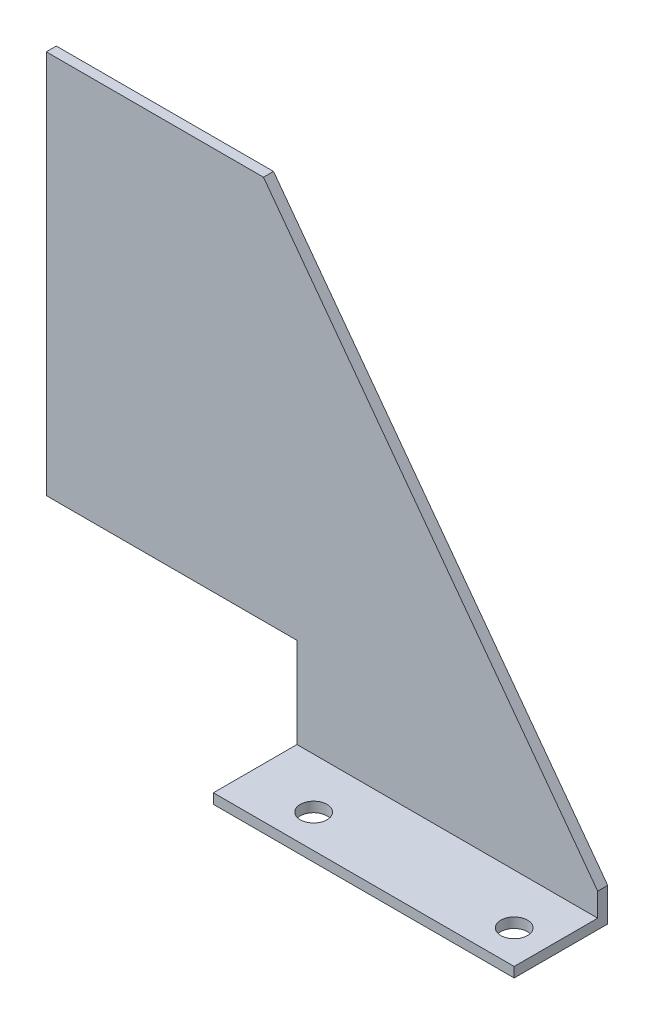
ISO-10303-21;
HEADER;
FILE_DESCRIPTION(('STEP AP214'),'2;1');
FILE_NAME('part.step','',(''),(''),'','','');
FILE_SCHEMA(('AUTOMOTIVE_DESIGN { 1 0 10303 214 1 1 1 1 }'));
ENDSEC;
DATA;
#1=APPLICATION_CONTEXT('core data for automotive mechanical design processes');
#2=APPLICATION_PROTOCOL_DEFINITION('international standard','automotive_design',2000,#1);
#3=PRODUCT_CONTEXT('',#1,'mechanical');
#4=PRODUCT('Part','Part','',(#3));
#5=PRODUCT_RELATED_PRODUCT_CATEGORY('part','',(#4));
#6=PRODUCT_DEFINITION_FORMATION('','',#4);
#7=PRODUCT_DEFINITION_CONTEXT('part definition',#1,'design');
#8=PRODUCT_DEFINITION('design','',#6,#7);
#9=PRODUCT_DEFINITION_SHAPE('','',#8);
#10=(LENGTH_UNIT() NAMED_UNIT(*) SI_UNIT(.MILLI.,.METRE.));
#11=(NAMED_UNIT(*) PLANE_ANGLE_UNIT() SI_UNIT($,.RADIAN.));
#12=(NAMED_UNIT(*) SI_UNIT($,.STERADIAN.) SOLID_ANGLE_UNIT());
#13=UNCERTAINTY_MEASURE_WITH_UNIT(LENGTH_MEASURE(1.E-05),#10,'distance_accuracy_value','');
#14=(GEOMETRIC_REPRESENTATION_CONTEXT(3) GLOBAL_UNCERTAINTY_ASSIGNED_CONTEXT((#13)) GLOBAL_UNIT_ASSIGNED_CONTEXT((#10,
#11,#12)) REPRESENTATION_CONTEXT('',''));
#15=CARTESIAN_POINT('',(0.,0.,0.));
#16=DIRECTION('',(0.,0.,1.));
#17=DIRECTION('',(1.,0.,0.));
#18=AXIS2_PLACEMENT_3D('',#15,#16,#17);
#19=CARTESIAN_POINT('',(0.,12.6977591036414,3.));
#20=DIRECTION('',(0.,0.,-1.));
#21=DIRECTION('',(-1.,0.,0.));
#22=AXIS2_PLACEMENT_3D('',#19,#20,#21);
#23=PLANE('',#22);
#24=DIRECTION('',(-1.,0.,0.));
#25=VECTOR('',#24,1.);
#26=CARTESIAN_POINT('',(75.,-14.3046237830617,3.));
#27=LINE('',#26,#25);
#28=CARTESIAN_POINT('',(165.,-14.3046237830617,3.));
#29=VERTEX_POINT('',#28);
#30=CARTESIAN_POINT('',(75.,-14.3046237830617,3.));
#31=VERTEX_POINT('',#30);
#32=EDGE_CURVE('E34',#29,#31,#27,.T.);
#33=ORIENTED_EDGE('',*,*,#32,.F.);
#34=DIRECTION('',(0.,1.,0.));
#35=VECTOR('',#34,1.);
#36=CARTESIAN_POINT('',(165.,-7.30224089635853,3.));
#37=LINE('',#36,#35);
#38=CARTESIAN_POINT('',(165.,-7.30224089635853,3.));
#39=VERTEX_POINT('',#38);
#40=EDGE_CURVE('E93',#29,#39,#37,.T.);
#41=ORIENTED_EDGE('',*,*,#40,.T.);
#42=DIRECTION('',(-0.595227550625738,0.803557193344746,0.));
#43=VECTOR('',#42,1.);
#44=CARTESIAN_POINT('',(65.,127.697759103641,3.));
#45=LINE('',#44,#43);
#46=CARTESIAN_POINT('',(65.,127.697759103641,3.));
#47=VERTEX_POINT('',#46);
#48=EDGE_CURVE('E166',#39,#47,#45,.T.);
#49=ORIENTED_EDGE('',*,*,#48,.T.);
#50=DIRECTION('',(-1.,0.,0.));
#51=VECTOR('',#50,1.);
#52=CARTESIAN_POINT('',(0.,127.697759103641,3.));
#53=LINE('',#52,#51);
#54=CARTESIAN_POINT('',(0.,127.697759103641,3.));
#55=VERTEX_POINT('',#54);
#56=EDGE_CURVE('E165',#47,#55,#53,.T.);
#57=ORIENTED_EDGE('',*,*,#56,.T.);
#58=DIRECTION('',(0.,-1.,0.));
#59=VECTOR('',#58,1.);
#60=CARTESIAN_POINT('',(0.,12.6977591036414,3.));
#61=LINE('',#60,#59);
#62=CARTESIAN_POINT('',(0.,12.6977591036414,3.));
#63=VERTEX_POINT('',#62);
#64=EDGE_CURVE('E41',#55,#63,#61,.T.);
#65=ORIENTED_EDGE('',*,*,#64,.T.);
#66=DIRECTION('',(1.,0.,0.));
#67=VECTOR('',#66,1.);
#68=CARTESIAN_POINT('',(75.,12.6977591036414,3.));
#69=LINE('',#68,#67);
#70=CARTESIAN_POINT('',(75.,12.6977591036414,3.));
#71=VERTEX_POINT('',#70);
#72=EDGE_CURVE('E89',#63,#71,#69,.T.);
#73=ORIENTED_EDGE('',*,*,#72,.T.);
#74=DIRECTION('',(0.,-1.,0.));
#75=VECTOR('',#74,1.);
#76=CARTESIAN_POINT('',(75.,-17.3022408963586,3.));
#77=LINE('',#76,#75);
#78=EDGE_CURVE('E87',#71,#31,#77,.T.);
#79=ORIENTED_EDGE('',*,*,#78,.T.);
#80=EDGE_LOOP('',(#33,#41,#49,#57,#65,#73,#79));
#81=FACE_BOUND('',#80,.T.);
#82=ADVANCED_FACE('F17',(#81),#23,.F.);
#83=CARTESIAN_POINT('',(75.,12.6977591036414,3.));
#84=DIRECTION('',(0.,1.,0.));
#85=DIRECTION('',(-1.,0.,0.));
#86=AXIS2_PLACEMENT_3D('',#83,#84,#85);
#87=PLANE('',#86);
#88=DIRECTION('',(1.,0.,0.));
#89=VECTOR('',#88,1.);
#90=CARTESIAN_POINT('',(75.,12.6977591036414,0.));
#91=LINE('',#90,#89);
#92=CARTESIAN_POINT('',(0.,12.6977591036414,0.));
#93=VERTEX_POINT('',#92);
#94=CARTESIAN_POINT('',(75.,12.6977591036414,0.));
#95=VERTEX_POINT('',#94);
#96=EDGE_CURVE('E111',#93,#95,#91,.T.);
#97=ORIENTED_EDGE('',*,*,#96,.T.);
#98=DIRECTION('',(0.,0.,-1.));
#99=VECTOR('',#98,1.);
#100=CARTESIAN_POINT('',(75.,12.6977591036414,3.));
#101=LINE('',#100,#99);
#102=EDGE_CURVE('E11',#71,#95,#101,.T.);
#103=ORIENTED_EDGE('',*,*,#102,.F.);
#104=ORIENTED_EDGE('',*,*,#72,.F.);
#105=DIRECTION('',(0.,0.,-1.));
#106=VECTOR('',#105,1.);
#107=CARTESIAN_POINT('',(0.,12.6977591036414,3.));
#108=LINE('',#107,#106);
#109=EDGE_CURVE('E161',#63,#93,#108,.T.);
#110=ORIENTED_EDGE('',*,*,#109,.T.);
#111=EDGE_LOOP('',(#97,#103,#104,#110));
#112=FACE_BOUND('',#111,.T.);
#113=ADVANCED_FACE('F19',(#112),#87,.F.);
#114=CARTESIAN_POINT('',(75.,-17.3022408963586,3.));
#115=DIRECTION('',(1.,0.,0.));
#116=DIRECTION('',(0.,1.,0.));
#117=AXIS2_PLACEMENT_3D('',#114,#115,#116);
#118=PLANE('',#117);
#119=DIRECTION('',(0.,-1.,0.));
#120=VECTOR('',#119,1.);
#121=CARTESIAN_POINT('',(75.,-17.3022408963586,0.));
#122=LINE('',#121,#120);
#123=CARTESIAN_POINT('',(75.,-17.3022408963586,0.));
#124=VERTEX_POINT('',#123);
#125=EDGE_CURVE('E130',#95,#124,#122,.T.);
#126=ORIENTED_EDGE('',*,*,#125,.T.);
#127=DIRECTION('',(0.,0.,-1.));
#128=VECTOR('',#127,1.);
#129=CARTESIAN_POINT('',(75.,-17.3022408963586,3.));
#130=LINE('',#129,#128);
#131=CARTESIAN_POINT('',(75.,-17.3022408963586,28.));
#132=VERTEX_POINT('',#131);
#133=EDGE_CURVE('E26',#132,#124,#130,.T.);
#134=ORIENTED_EDGE('',*,*,#133,.F.);
#135=DIRECTION('',(0.,-1.,0.));
#136=VECTOR('',#135,1.);
#137=CARTESIAN_POINT('',(75.,-17.3022408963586,28.));
#138=LINE('',#137,#136);
#139=CARTESIAN_POINT('',(75.,-14.3046237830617,28.));
#140=VERTEX_POINT('',#139);
#141=EDGE_CURVE('E104',#140,#132,#138,.T.);
#142=ORIENTED_EDGE('',*,*,#141,.F.);
#143=DIRECTION('',(0.,0.,-1.));
#144=VECTOR('',#143,1.);
#145=CARTESIAN_POINT('',(75.,-14.3046237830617,28.));
#146=LINE('',#145,#144);
#147=EDGE_CURVE('E100',#140,#31,#146,.T.);
#148=ORIENTED_EDGE('',*,*,#147,.T.);
#149=ORIENTED_EDGE('',*,*,#78,.F.);
#150=ORIENTED_EDGE('',*,*,#102,.T.);
#151=EDGE_LOOP('',(#126,#134,#142,#148,#149,#150));
#152=FACE_BOUND('',#151,.T.);
#153=ADVANCED_FACE('F107',(#152),#118,.F.);
#154=CARTESIAN_POINT('',(165.,-17.3022408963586,3.));
#155=DIRECTION('',(0.,1.,0.));
#156=DIRECTION('',(-1.,0.,0.));
#157=AXIS2_PLACEMENT_3D('',#154,#155,#156);
#158=PLANE('',#157);
#159=CARTESIAN_POINT('',(95.,-17.3022408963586,18.));
#160=DIRECTION('',(0.,1.,0.));
#161=DIRECTION('',(-1.,0.,0.));
#162=AXIS2_PLACEMENT_3D('',#159,#160,#161);
#163=CIRCLE('',#162,4.);
#164=CARTESIAN_POINT('',(91.,-17.3022408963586,18.));
#165=VERTEX_POINT('',#164);
#166=EDGE_CURVE('E258',#165,#165,#163,.T.);
#167=ORIENTED_EDGE('',*,*,#166,.T.);
#168=EDGE_LOOP('',(#167));
#169=FACE_BOUND('',#168,.T.);
#170=CARTESIAN_POINT('',(155.,-17.3022408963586,18.));
#171=DIRECTION('',(0.,1.,0.));
#172=DIRECTION('',(-1.,0.,0.));
#173=AXIS2_PLACEMENT_3D('',#170,#171,#172);
#174=CIRCLE('',#173,4.);
#175=CARTESIAN_POINT('',(151.,-17.3022408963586,18.));
#176=VERTEX_POINT('',#175);
#177=EDGE_CURVE('E105',#176,#176,#174,.T.);
#178=ORIENTED_EDGE('',*,*,#177,.T.);
#179=EDGE_LOOP('',(#178));
#180=FACE_BOUND('',#179,.T.);
#181=DIRECTION('',(1.,0.,0.));
#182=VECTOR('',#181,1.);
#183=CARTESIAN_POINT('',(165.,-17.3022408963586,0.));
#184=LINE('',#183,#182);
#185=CARTESIAN_POINT('',(165.,-17.3022408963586,0.));
#186=VERTEX_POINT('',#185);
#187=EDGE_CURVE('E132',#124,#186,#184,.T.);
#188=ORIENTED_EDGE('',*,*,#187,.T.);
#189=DIRECTION('',(0.,0.,-1.));
#190=VECTOR('',#189,1.);
#191=CARTESIAN_POINT('',(165.,-17.3022408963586,3.));
#192=LINE('',#191,#190);
#193=CARTESIAN_POINT('',(165.,-17.3022408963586,28.));
#194=VERTEX_POINT('',#193);
#195=EDGE_CURVE('E149',#194,#186,#192,.T.);
#196=ORIENTED_EDGE('',*,*,#195,.F.);
#197=DIRECTION('',(1.,0.,0.));
#198=VECTOR('',#197,1.);
#199=CARTESIAN_POINT('',(75.,-17.3022408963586,28.));
#200=LINE('',#199,#198);
#201=EDGE_CURVE('E124',#132,#194,#200,.T.);
#202=ORIENTED_EDGE('',*,*,#201,.F.);
#203=ORIENTED_EDGE('',*,*,#133,.T.);
#204=EDGE_LOOP('',(#188,#196,#202,#203));
#205=FACE_BOUND('',#204,.T.);
#206=ADVANCED_FACE('F190',(#169,#180,#205),#158,.F.);
#207=CARTESIAN_POINT('',(165.,-7.30224089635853,3.));
#208=DIRECTION('',(-1.,0.,0.));
#209=DIRECTION('',(0.,-1.,0.));
#210=AXIS2_PLACEMENT_3D('',#207,#208,#209);
#211=PLANE('',#210);
#212=DIRECTION('',(0.,1.,0.));
#213=VECTOR('',#212,1.);
#214=CARTESIAN_POINT('',(165.,-7.30224089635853,0.));
#215=LINE('',#214,#213);
#216=CARTESIAN_POINT('',(165.,-7.30224089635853,0.));
#217=VERTEX_POINT('',#216);
#218=EDGE_CURVE('E134',#186,#217,#215,.T.);
#219=ORIENTED_EDGE('',*,*,#218,.T.);
#220=DIRECTION('',(0.,0.,-1.));
#221=VECTOR('',#220,1.);
#222=CARTESIAN_POINT('',(165.,-7.30224089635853,3.));
#223=LINE('',#222,#221);
#224=EDGE_CURVE('E152',#39,#217,#223,.T.);
#225=ORIENTED_EDGE('',*,*,#224,.F.);
#226=ORIENTED_EDGE('',*,*,#40,.F.);
#227=DIRECTION('',(0.,0.,-1.));
#228=VECTOR('',#227,1.);
#229=CARTESIAN_POINT('',(165.,-14.3046237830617,28.));
#230=LINE('',#229,#228);
#231=CARTESIAN_POINT('',(165.,-14.3046237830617,28.));
#232=VERTEX_POINT('',#231);
#233=EDGE_CURVE('E103',#232,#29,#230,.T.);
#234=ORIENTED_EDGE('',*,*,#233,.F.);
#235=DIRECTION('',(0.,1.,0.));
#236=VECTOR('',#235,1.);
#237=CARTESIAN_POINT('',(165.,-14.3046237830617,28.));
#238=LINE('',#237,#236);
#239=EDGE_CURVE('E112',#194,#232,#238,.T.);
#240=ORIENTED_EDGE('',*,*,#239,.F.);
#241=ORIENTED_EDGE('',*,*,#195,.T.);
#242=EDGE_LOOP('',(#219,#225,#226,#234,#240,#241));
#243=FACE_BOUND('',#242,.T.);
#244=ADVANCED_FACE('F171',(#243),#211,.F.);
#245=CARTESIAN_POINT('',(65.,127.697759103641,3.));
#246=DIRECTION('',(-0.803557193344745,-0.595227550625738,0.));
#247=DIRECTION('',(0.595227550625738,-0.803557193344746,0.));
#248=AXIS2_PLACEMENT_3D('',#245,#246,#247);
#249=PLANE('',#248);
#250=DIRECTION('',(-0.595227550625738,0.803557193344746,0.));
#251=VECTOR('',#250,1.);
#252=CARTESIAN_POINT('',(65.,127.697759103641,0.));
#253=LINE('',#252,#251);
#254=CARTESIAN_POINT('',(65.,127.697759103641,0.));
#255=VERTEX_POINT('',#254);
#256=EDGE_CURVE('E136',#217,#255,#253,.T.);
#257=ORIENTED_EDGE('',*,*,#256,.T.);
#258=DIRECTION('',(0.,0.,-1.));
#259=VECTOR('',#258,1.);
#260=CARTESIAN_POINT('',(65.,127.697759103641,3.));
#261=LINE('',#260,#259);
#262=EDGE_CURVE('E155',#47,#255,#261,.T.);
#263=ORIENTED_EDGE('',*,*,#262,.F.);
#264=ORIENTED_EDGE('',*,*,#48,.F.);
#265=ORIENTED_EDGE('',*,*,#224,.T.);
#266=EDGE_LOOP('',(#257,#263,#264,#265));
#267=FACE_BOUND('',#266,.T.);
#268=ADVANCED_FACE('F175',(#267),#249,.F.);
#269=CARTESIAN_POINT('',(0.,127.697759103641,3.));
#270=DIRECTION('',(0.,-1.,0.));
#271=DIRECTION('',(1.,0.,0.));
#272=AXIS2_PLACEMENT_3D('',#269,#270,#271);
#273=PLANE('',#272);
#274=DIRECTION('',(-1.,0.,0.));
#275=VECTOR('',#274,1.);
#276=CARTESIAN_POINT('',(0.,127.697759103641,0.));
#277=LINE('',#276,#275);
#278=CARTESIAN_POINT('',(0.,127.697759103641,0.));
#279=VERTEX_POINT('',#278);
#280=EDGE_CURVE('E138',#255,#279,#277,.T.);
#281=ORIENTED_EDGE('',*,*,#280,.T.);
#282=DIRECTION('',(0.,0.,-1.));
#283=VECTOR('',#282,1.);
#284=CARTESIAN_POINT('',(0.,127.697759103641,3.));
#285=LINE('',#284,#283);
#286=EDGE_CURVE('E158',#55,#279,#285,.T.);
#287=ORIENTED_EDGE('',*,*,#286,.F.);
#288=ORIENTED_EDGE('',*,*,#56,.F.);
#289=ORIENTED_EDGE('',*,*,#262,.T.);
#290=EDGE_LOOP('',(#281,#287,#288,#289));
#291=FACE_BOUND('',#290,.T.);
#292=ADVANCED_FACE('F180',(#291),#273,.F.);
#293=CARTESIAN_POINT('',(0.,12.6977591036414,3.));
#294=DIRECTION('',(1.,0.,0.));
#295=DIRECTION('',(0.,0.,-1.));
#296=AXIS2_PLACEMENT_3D('',#293,#294,#295);
#297=PLANE('',#296);
#298=DIRECTION('',(0.,-1.,0.));
#299=VECTOR('',#298,1.);
#300=CARTESIAN_POINT('',(0.,12.6977591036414,0.));
#301=LINE('',#300,#299);
#302=EDGE_CURVE('E140',#279,#93,#301,.T.);
#303=ORIENTED_EDGE('',*,*,#302,.T.);
#304=ORIENTED_EDGE('',*,*,#109,.F.);
#305=ORIENTED_EDGE('',*,*,#64,.F.);
#306=ORIENTED_EDGE('',*,*,#286,.T.);
#307=EDGE_LOOP('',(#303,#304,#305,#306));
#308=FACE_BOUND('',#307,.T.);
#309=ADVANCED_FACE('F183',(#308),#297,.F.);
#310=CARTESIAN_POINT('',(0.,12.6977591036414,0.));
#311=DIRECTION('',(0.,0.,-1.));
#312=DIRECTION('',(-1.,0.,0.));
#313=AXIS2_PLACEMENT_3D('',#310,#311,#312);
#314=PLANE('',#313);
#315=ORIENTED_EDGE('',*,*,#96,.F.);
#316=ORIENTED_EDGE('',*,*,#302,.F.);
#317=ORIENTED_EDGE('',*,*,#280,.F.);
#318=ORIENTED_EDGE('',*,*,#256,.F.);
#319=ORIENTED_EDGE('',*,*,#218,.F.);
#320=ORIENTED_EDGE('',*,*,#187,.F.);
#321=ORIENTED_EDGE('',*,*,#125,.F.);
#322=EDGE_LOOP('',(#315,#316,#317,#318,#319,#320,#321));
#323=FACE_BOUND('',#322,.T.);
#324=ADVANCED_FACE('F191',(#323),#314,.T.);
#325=CARTESIAN_POINT('',(75.,-14.3046237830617,28.));
#326=DIRECTION('',(0.,-1.,0.));
#327=DIRECTION('',(0.,0.,-1.));
#328=AXIS2_PLACEMENT_3D('',#325,#326,#327);
#329=PLANE('',#328);
#330=CARTESIAN_POINT('',(95.,-14.3046237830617,18.));
#331=DIRECTION('',(0.,1.,0.));
#332=DIRECTION('',(0.,0.,1.));
#333=AXIS2_PLACEMENT_3D('',#330,#331,#332);
#334=CIRCLE('',#333,4.);
#335=CARTESIAN_POINT('',(95.,-14.3046237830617,22.));
#336=VERTEX_POINT('',#335);
#337=EDGE_CURVE('E255',#336,#336,#334,.T.);
#338=ORIENTED_EDGE('',*,*,#337,.F.);
#339=EDGE_LOOP('',(#338));
#340=FACE_BOUND('',#339,.T.);
#341=CARTESIAN_POINT('',(155.,-14.3046237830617,18.));
#342=DIRECTION('',(0.,1.,0.));
#343=DIRECTION('',(0.,0.,1.));
#344=AXIS2_PLACEMENT_3D('',#341,#342,#343);
#345=CIRCLE('',#344,4.);
#346=CARTESIAN_POINT('',(155.,-14.3046237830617,22.));
#347=VERTEX_POINT('',#346);
#348=EDGE_CURVE('E259',#347,#347,#345,.T.);
#349=ORIENTED_EDGE('',*,*,#348,.F.);
#350=EDGE_LOOP('',(#349));
#351=FACE_BOUND('',#350,.T.);
#352=ORIENTED_EDGE('',*,*,#32,.T.);
#353=ORIENTED_EDGE('',*,*,#147,.F.);
#354=DIRECTION('',(-1.,0.,0.));
#355=VECTOR('',#354,1.);
#356=CARTESIAN_POINT('',(75.,-14.3046237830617,28.));
#357=LINE('',#356,#355);
#358=EDGE_CURVE('E109',#232,#140,#357,.T.);
#359=ORIENTED_EDGE('',*,*,#358,.F.);
#360=ORIENTED_EDGE('',*,*,#233,.T.);
#361=EDGE_LOOP('',(#352,#353,#359,#360));
#362=FACE_BOUND('',#361,.T.);
#363=ADVANCED_FACE('F98',(#340,#351,#362),#329,.F.);
#364=CARTESIAN_POINT('',(75.,-14.3046237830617,28.));
#365=DIRECTION('',(0.,0.,-1.));
#366=DIRECTION('',(-1.,0.,0.));
#367=AXIS2_PLACEMENT_3D('',#364,#365,#366);
#368=PLANE('',#367);
#369=ORIENTED_EDGE('',*,*,#141,.T.);
#370=ORIENTED_EDGE('',*,*,#201,.T.);
#371=ORIENTED_EDGE('',*,*,#239,.T.);
#372=ORIENTED_EDGE('',*,*,#358,.T.);
#373=EDGE_LOOP('',(#369,#370,#371,#372));
#374=FACE_BOUND('',#373,.T.);
#375=ADVANCED_FACE('F198',(#374),#368,.F.);
#376=CARTESIAN_POINT('',(155.,-19.3046237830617,18.));
#377=DIRECTION('',(0.,1.,0.));
#378=DIRECTION('',(0.,0.,1.));
#379=AXIS2_PLACEMENT_3D('',#376,#377,#378);
#380=CYLINDRICAL_SURFACE('',#379,4.);
#381=ORIENTED_EDGE('',*,*,#348,.T.);
#382=EDGE_LOOP('',(#381));
#383=FACE_BOUND('',#382,.T.);
#384=ORIENTED_EDGE('',*,*,#177,.F.);
#385=EDGE_LOOP('',(#384));
#386=FACE_BOUND('',#385,.T.);
#387=ADVANCED_FACE('F231',(#383,#386),#380,.F.);
#388=CARTESIAN_POINT('',(95.,-19.3046237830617,18.));
#389=DIRECTION('',(0.,1.,0.));
#390=DIRECTION('',(0.,0.,1.));
#391=AXIS2_PLACEMENT_3D('',#388,#389,#390);
#392=CYLINDRICAL_SURFACE('',#391,4.);
#393=ORIENTED_EDGE('',*,*,#337,.T.);
#394=EDGE_LOOP('',(#393));
#395=FACE_BOUND('',#394,.T.);
#396=ORIENTED_EDGE('',*,*,#166,.F.);
#397=EDGE_LOOP('',(#396));
#398=FACE_BOUND('',#397,.T.);
#399=ADVANCED_FACE('F239',(#395,#398),#392,.F.);
#400=CLOSED_SHELL('',(#82,#113,#153,#206,#244,#268,#292,#309,#324,#363,#375,#387,#399));
#401=MANIFOLD_SOLID_BREP('B1',#400);
#402=ADVANCED_BREP_SHAPE_REPRESENTATION('',(#18,#401),#14);
#403=SHAPE_DEFINITION_REPRESENTATION(#9,#402);
ENDSEC;
END-ISO-10303-21;
